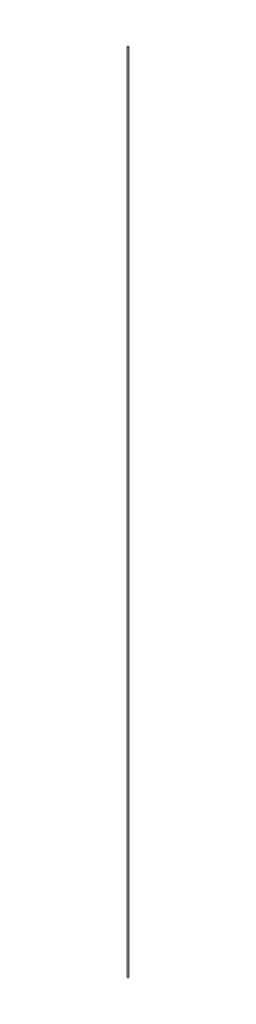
from build123d import *

# Parameters (mm, degrees)
ESQUISSE1_R        = 0.15
BOSS_EXTRU_1_DEPTH = 200


with BuildPart() as part:
    # Esquisse1 → Boss.-Extru.1 (new body)
    with BuildSketch(Plane(origin=(0, 0, 0), x_dir=(1, 0, 0), z_dir=(0, 1, 0))):
        with Locations(Location((0, 0, 0), (0, 0, 270))):
            Circle(ESQUISSE1_R)
    extrude(amount=BOSS_EXTRU_1_DEPTH)


solid = part.part
